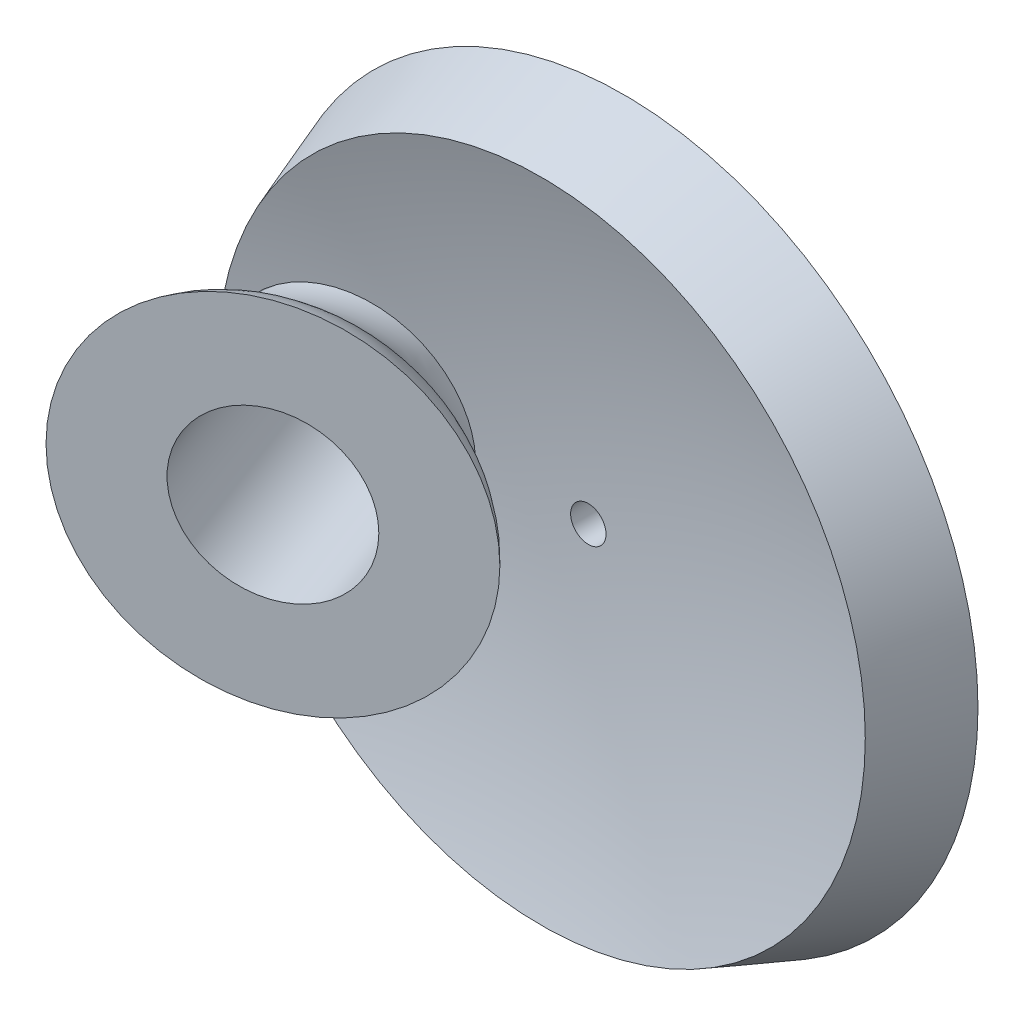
ISO-10303-21;
HEADER;
FILE_DESCRIPTION(('STEP AP214'),'2;1');
FILE_NAME('part.step','',(''),(''),'','','');
FILE_SCHEMA(('AUTOMOTIVE_DESIGN { 1 0 10303 214 1 1 1 1 }'));
ENDSEC;
DATA;
#1=APPLICATION_CONTEXT('core data for automotive mechanical design processes');
#2=APPLICATION_PROTOCOL_DEFINITION('international standard','automotive_design',2000,#1);
#3=PRODUCT_CONTEXT('',#1,'mechanical');
#4=PRODUCT('Part','Part','',(#3));
#5=PRODUCT_RELATED_PRODUCT_CATEGORY('part','',(#4));
#6=PRODUCT_DEFINITION_FORMATION('','',#4);
#7=PRODUCT_DEFINITION_CONTEXT('part definition',#1,'design');
#8=PRODUCT_DEFINITION('design','',#6,#7);
#9=PRODUCT_DEFINITION_SHAPE('','',#8);
#10=(LENGTH_UNIT() NAMED_UNIT(*) SI_UNIT(.MILLI.,.METRE.));
#11=(NAMED_UNIT(*) PLANE_ANGLE_UNIT() SI_UNIT($,.RADIAN.));
#12=(NAMED_UNIT(*) SI_UNIT($,.STERADIAN.) SOLID_ANGLE_UNIT());
#13=UNCERTAINTY_MEASURE_WITH_UNIT(LENGTH_MEASURE(1.E-05),#10,'distance_accuracy_value','');
#14=(GEOMETRIC_REPRESENTATION_CONTEXT(3) GLOBAL_UNCERTAINTY_ASSIGNED_CONTEXT((#13)) GLOBAL_UNIT_ASSIGNED_CONTEXT((#10,
#11,#12)) REPRESENTATION_CONTEXT('',''));
#15=CARTESIAN_POINT('',(0.,0.,0.));
#16=DIRECTION('',(0.,0.,1.));
#17=DIRECTION('',(1.,0.,0.));
#18=AXIS2_PLACEMENT_3D('',#15,#16,#17);
#19=CARTESIAN_POINT('',(0.,0.,99.2029679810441));
#20=DIRECTION('',(0.,0.,1.));
#21=DIRECTION('',(1.,0.,0.));
#22=AXIS2_PLACEMENT_3D('',#19,#20,#21);
#23=SPHERICAL_SURFACE('',#22,96.2029679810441);
#24=CARTESIAN_POINT('',(0.,0.,7.));
#25=DIRECTION('',(0.,0.,1.));
#26=DIRECTION('',(1.,0.,0.));
#27=AXIS2_PLACEMENT_3D('',#24,#25,#26);
#28=CIRCLE('',#27,27.4522083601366);
#29=CARTESIAN_POINT('',(27.4522083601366,0.,7.));
#30=VERTEX_POINT('',#29);
#31=EDGE_CURVE('E52',#30,#30,#28,.T.);
#32=ORIENTED_EDGE('',*,*,#31,.T.);
#33=EDGE_LOOP('',(#32));
#34=FACE_BOUND('',#33,.T.);
#35=CARTESIAN_POINT('',(0.,0.,3.01169473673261));
#36=DIRECTION('',(0.,0.,1.));
#37=DIRECTION('',(1.,0.,0.));
#38=AXIS2_PLACEMENT_3D('',#35,#36,#37);
#39=CIRCLE('',#38,1.5);
#40=CARTESIAN_POINT('',(1.5,0.,3.01169473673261));
#41=VERTEX_POINT('',#40);
#42=EDGE_CURVE('E92',#41,#41,#39,.T.);
#43=ORIENTED_EDGE('',*,*,#42,.F.);
#44=EDGE_LOOP('',(#43));
#45=FACE_BOUND('',#44,.T.);
#46=CARTESIAN_POINT('',(-9.39672620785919,0.49956979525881,3.46132074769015));
#47=CARTESIAN_POINT('',(-9.41056295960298,0.749809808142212,3.46398465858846));
#48=CARTESIAN_POINT('',(-9.43480235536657,0.999497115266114,3.46865138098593));
#49=CARTESIAN_POINT('',(-9.50391822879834,1.49599468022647,3.48195930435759));
#50=CARTESIAN_POINT('',(-9.54880500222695,1.74280343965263,3.49060248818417));
#51=CARTESIAN_POINT('',(-9.6589603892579,2.23207215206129,3.51181650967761));
#52=CARTESIAN_POINT('',(-9.72426093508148,2.47452465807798,3.5243935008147));
#53=CARTESIAN_POINT('',(-9.87472269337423,2.95295573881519,3.55337806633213));
#54=CARTESIAN_POINT('',(-9.95988443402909,3.18893414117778,3.56978574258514));
#55=CARTESIAN_POINT('',(-10.1493192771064,3.65250198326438,3.6062914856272));
#56=CARTESIAN_POINT('',(-10.2535721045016,3.88010001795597,3.62638563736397));
#57=CARTESIAN_POINT('',(-10.4804674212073,4.32558729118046,3.67013011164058));
#58=CARTESIAN_POINT('',(-10.6031104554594,4.54347624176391,3.69378053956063));
#59=CARTESIAN_POINT('',(-10.865792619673,4.96790825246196,3.7444514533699));
#60=CARTESIAN_POINT('',(-11.0058214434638,5.17445793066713,3.77146994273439));
#61=CARTESIAN_POINT('',(-11.3023532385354,5.57501124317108,3.82870497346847));
#62=CARTESIAN_POINT('',(-11.4588619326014,5.76901048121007,3.85892262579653));
#63=CARTESIAN_POINT('',(-11.7882137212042,6.14426031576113,3.92253524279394));
#64=CARTESIAN_POINT('',(-11.9611538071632,6.3254225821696,3.95594908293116));
#65=CARTESIAN_POINT('',(-12.3212702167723,6.67242183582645,4.02555536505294));
#66=CARTESIAN_POINT('',(-12.5084469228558,6.83825841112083,4.06174788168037));
#67=CARTESIAN_POINT('',(-12.895707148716,7.15351322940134,4.13666068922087));
#68=CARTESIAN_POINT('',(-13.0957919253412,7.30292986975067,4.17538122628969));
#69=CARTESIAN_POINT('',(-13.507436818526,7.58434767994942,4.25507900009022));
#70=CARTESIAN_POINT('',(-13.7189972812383,7.71634832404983,4.29605630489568));
#71=CARTESIAN_POINT('',(-14.1546859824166,7.96353574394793,4.38048494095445));
#72=CARTESIAN_POINT('',(-14.3789338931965,8.07850354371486,4.42395992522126));
#73=CARTESIAN_POINT('',(-14.8361408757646,8.2890017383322,4.51264244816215));
#74=CARTESIAN_POINT('',(-15.0691029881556,8.3845252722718,4.55785059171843));
#75=CARTESIAN_POINT('',(-15.5419383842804,8.55543009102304,4.64965447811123));
#76=CARTESIAN_POINT('',(-15.781809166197,8.63081856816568,4.69624971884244));
#77=CARTESIAN_POINT('',(-16.2669747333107,8.76103893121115,4.79054233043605));
#78=CARTESIAN_POINT('',(-16.5122719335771,8.81586146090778,4.83824019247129));
#79=CARTESIAN_POINT('',(-17.0090405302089,8.90500664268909,4.93488673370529));
#80=CARTESIAN_POINT('',(-17.2605495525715,8.93911124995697,4.98384324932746));
#81=CARTESIAN_POINT('',(-17.7653670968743,8.98568952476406,5.08215835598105));
#82=CARTESIAN_POINT('',(-18.0186747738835,8.99817275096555,5.13151675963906));
#83=CARTESIAN_POINT('',(-18.5255250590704,9.0014552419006,5.23033116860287));
#84=CARTESIAN_POINT('',(-18.7790677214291,8.99224518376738,5.279787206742));
#85=CARTESIAN_POINT('',(-19.2844019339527,8.95218686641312,5.37840887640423));
#86=CARTESIAN_POINT('',(-19.536194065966,8.92134618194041,5.42757460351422));
#87=CARTESIAN_POINT('',(-20.0374108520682,8.83805615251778,5.52549363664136));
#88=CARTESIAN_POINT('',(-20.2868207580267,8.78551487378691,5.57424427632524));
#89=CARTESIAN_POINT('',(-20.7803833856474,8.65916505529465,5.67076606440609));
#90=CARTESIAN_POINT('',(-21.0245362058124,8.58535691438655,5.71853723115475));
#91=CARTESIAN_POINT('',(-21.5058382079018,8.41696166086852,5.81275462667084));
#92=CARTESIAN_POINT('',(-21.7429872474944,8.32237412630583,5.85920082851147));
#93=CARTESIAN_POINT('',(-22.2085517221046,8.11305773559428,5.95042489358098));
#94=CARTESIAN_POINT('',(-22.4369673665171,7.99832936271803,5.99520279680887));
#95=CARTESIAN_POINT('',(-22.8825763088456,7.74996668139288,6.08259699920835));
#96=CARTESIAN_POINT('',(-23.0998078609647,7.61640360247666,6.1252206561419));
#97=CARTESIAN_POINT('',(-23.522278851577,7.33101563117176,6.20814913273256));
#98=CARTESIAN_POINT('',(-23.7275225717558,7.17919731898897,6.24845478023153));
#99=CARTESIAN_POINT('',(-24.124608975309,6.85828351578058,6.32646430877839));
#100=CARTESIAN_POINT('',(-24.3164497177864,6.68918553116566,6.36416781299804));
#101=CARTESIAN_POINT('',(-24.6852571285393,6.33491135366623,6.43667710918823));
#102=CARTESIAN_POINT('',(-24.8622239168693,6.14973529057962,6.4714829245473));
#103=CARTESIAN_POINT('',(-25.1982435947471,5.76654954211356,6.53759236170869));
#104=CARTESIAN_POINT('',(-25.3574585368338,5.56868741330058,6.56892764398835));
#105=CARTESIAN_POINT('',(-25.6587970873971,5.159878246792,6.6282511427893));
#106=CARTESIAN_POINT('',(-25.8009208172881,4.94893130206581,6.65623938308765));
#107=CARTESIAN_POINT('',(-26.0669888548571,4.51546098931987,6.70864864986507));
#108=CARTESIAN_POINT('',(-26.1909340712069,4.29293820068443,6.73306985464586));
#109=CARTESIAN_POINT('',(-26.4196997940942,3.83790486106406,6.77815339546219));
#110=CARTESIAN_POINT('',(-26.5245204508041,3.60539438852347,6.79881576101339));
#111=CARTESIAN_POINT('',(-26.7131106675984,3.13485032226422,6.83599708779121));
#112=CARTESIAN_POINT('',(-26.7971127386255,2.89691350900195,6.85256180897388));
#113=CARTESIAN_POINT('',(-26.9450025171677,2.41463280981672,6.88172847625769));
#114=CARTESIAN_POINT('',(-27.0088904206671,2.1702889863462,6.89433046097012));
#115=CARTESIAN_POINT('',(-27.1160587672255,1.67696131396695,6.91547137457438));
#116=CARTESIAN_POINT('',(-27.1593400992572,1.42797766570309,6.92401047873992));
#117=CARTESIAN_POINT('',(-27.2249648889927,0.927159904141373,6.93695835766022));
#118=CARTESIAN_POINT('',(-27.2473084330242,0.675325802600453,6.94136714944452));
#119=CARTESIAN_POINT('',(-27.270786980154,0.172731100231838,6.9459999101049));
#120=CARTESIAN_POINT('',(-27.2720966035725,-0.0780210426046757,6.94625833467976));
#121=CARTESIAN_POINT('',(-27.253944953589,-0.578741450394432,6.94267665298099));
#122=CARTESIAN_POINT('',(-27.234483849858,-0.828709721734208,6.93883658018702));
#123=CARTESIAN_POINT('',(-27.1749398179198,-1.32607621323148,6.92708825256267));
#124=CARTESIAN_POINT('',(-27.1348572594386,-1.57347447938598,6.91918007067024));
#125=CARTESIAN_POINT('',(-27.034375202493,-2.06394652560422,6.89935757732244));
#126=CARTESIAN_POINT('',(-26.9739756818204,-2.3070203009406,6.88744326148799));
#127=CARTESIAN_POINT('',(-26.8334272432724,-2.78674594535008,6.85972326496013));
#128=CARTESIAN_POINT('',(-26.7533094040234,-3.02340727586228,6.84392370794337));
#129=CARTESIAN_POINT('',(-26.5738461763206,-3.48912459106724,6.80853975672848));
#130=CARTESIAN_POINT('',(-26.4744941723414,-3.71817792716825,6.78895406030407));
#131=CARTESIAN_POINT('',(-26.2573388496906,-4.16696130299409,6.74615521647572));
#132=CARTESIAN_POINT('',(-26.1395386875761,-4.3866929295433,6.72294268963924));
#133=CARTESIAN_POINT('',(-25.8863412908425,-4.81536550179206,6.67306346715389));
#134=CARTESIAN_POINT('',(-25.7509436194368,-5.02430617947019,6.64639668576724));
#135=CARTESIAN_POINT('',(-25.4626793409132,-5.43118507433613,6.58963966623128));
#136=CARTESIAN_POINT('',(-25.3097127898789,-5.62904975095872,6.55952984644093));
#137=CARTESIAN_POINT('',(-24.9880891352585,-6.01106630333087,6.49624287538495));
#138=CARTESIAN_POINT('',(-24.8194316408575,-6.19521783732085,6.4630656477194));
#139=CARTESIAN_POINT('',(-24.4676741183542,-6.54853733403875,6.39389536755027));
#140=CARTESIAN_POINT('',(-24.2845761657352,-6.71770744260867,6.35790271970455));
#141=CARTESIAN_POINT('',(-23.9051601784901,-7.04002432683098,6.28334789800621));
#142=CARTESIAN_POINT('',(-23.7088375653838,-7.19316550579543,6.24478483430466));
#143=CARTESIAN_POINT('',(-23.3022482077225,-7.48390157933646,6.16495300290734));
#144=CARTESIAN_POINT('',(-23.0918546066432,-7.62131234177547,6.12365967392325));
#145=CARTESIAN_POINT('',(-22.6605345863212,-7.87776098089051,6.03904338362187));
#146=CARTESIAN_POINT('',(-22.4396078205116,-7.99679825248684,5.99572035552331));
#147=CARTESIAN_POINT('',(-21.9887814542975,-8.21571857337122,5.90735579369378));
#148=CARTESIAN_POINT('',(-21.7588815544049,-8.31560098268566,5.86231420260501));
#149=CARTESIAN_POINT('',(-21.2917258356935,-8.49555923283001,5.77083388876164));
#150=CARTESIAN_POINT('',(-21.0544699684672,-8.5756349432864,5.7243951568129));
#151=CARTESIAN_POINT('',(-20.5715441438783,-8.71625296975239,5.62991754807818));
#152=CARTESIAN_POINT('',(-20.325809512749,-8.77656510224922,5.58186653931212));
#153=CARTESIAN_POINT('',(-19.8302428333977,-8.87601345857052,5.48501283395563));
#154=CARTESIAN_POINT('',(-19.5804108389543,-8.91514996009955,5.43621014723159));
#155=CARTESIAN_POINT('',(-19.078344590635,-8.97200226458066,5.33818633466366));
#156=CARTESIAN_POINT('',(-18.8261098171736,-8.98971332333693,5.28896511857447));
#157=CARTESIAN_POINT('',(-18.32114689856,-9.00358372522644,5.19047783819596));
#158=CARTESIAN_POINT('',(-18.068418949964,-8.99975038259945,5.14121179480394));
#159=CARTESIAN_POINT('',(-17.56238628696,-8.97047342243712,5.04261874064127));
#160=CARTESIAN_POINT('',(-17.3090899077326,-8.94487880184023,4.99329371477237));
#161=CARTESIAN_POINT('',(-16.8055072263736,-8.87205004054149,4.89528097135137));
#162=CARTESIAN_POINT('',(-16.5552208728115,-8.82481627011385,4.84659324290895));
#163=CARTESIAN_POINT('',(-16.059426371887,-8.70902005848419,4.75019685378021));
#164=CARTESIAN_POINT('',(-15.8139184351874,-8.64045667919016,4.70248823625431));
#165=CARTESIAN_POINT('',(-15.3294569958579,-8.48245972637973,4.60839201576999));
#166=CARTESIAN_POINT('',(-15.0905033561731,-8.39302658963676,4.56200438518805));
#167=CARTESIAN_POINT('',(-14.6209912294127,-8.19393929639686,4.47090328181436));
#168=CARTESIAN_POINT('',(-14.3904284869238,-8.08429556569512,4.4261889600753));
#169=CARTESIAN_POINT('',(-13.9393269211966,-7.84553848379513,4.33874526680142));
#170=CARTESIAN_POINT('',(-13.7187845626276,-7.71643206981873,4.29601519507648));
#171=CARTESIAN_POINT('',(-13.2892423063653,-7.43959030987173,4.21282846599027));
#172=CARTESIAN_POINT('',(-13.080243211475,-7.29185367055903,4.17237196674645));
#173=CARTESIAN_POINT('',(-12.6753594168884,-6.97877669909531,4.09403040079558));
#174=CARTESIAN_POINT('',(-12.4794745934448,-6.81343653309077,4.05614530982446));
#175=CARTESIAN_POINT('',(-12.1038798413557,-6.46776600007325,3.98353171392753));
#176=CARTESIAN_POINT('',(-11.9240477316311,-6.28757340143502,3.94877934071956));
#177=CARTESIAN_POINT('',(-11.5800750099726,-5.91226452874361,3.88233047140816));
#178=CARTESIAN_POINT('',(-11.41593429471,-5.71714835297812,3.85063395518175));
#179=CARTESIAN_POINT('',(-11.1045233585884,-5.31327799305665,3.79051784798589));
#180=CARTESIAN_POINT('',(-10.9572603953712,-5.10451800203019,3.7620996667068));
#181=CARTESIAN_POINT('',(-10.6808247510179,-4.67493131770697,3.70876922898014));
#182=CARTESIAN_POINT('',(-10.5516513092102,-4.45410513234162,3.68385682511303));
#183=CARTESIAN_POINT('',(-10.3137540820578,-4.00454491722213,3.63798691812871));
#184=CARTESIAN_POINT('',(-10.2048146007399,-3.77592926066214,3.61698769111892));
#185=CARTESIAN_POINT('',(-10.0064341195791,-3.31009170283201,3.57875522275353));
#186=CARTESIAN_POINT('',(-9.91699232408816,-3.07287015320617,3.56152182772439));
#187=CARTESIAN_POINT('',(-9.75843898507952,-2.59196026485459,3.53097683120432));
#188=CARTESIAN_POINT('',(-9.68929149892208,-2.3482842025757,3.51765829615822));
#189=CARTESIAN_POINT('',(-9.571680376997,-1.85591722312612,3.49500754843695));
#190=CARTESIAN_POINT('',(-9.52320554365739,-1.60722909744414,3.48567317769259));
#191=CARTESIAN_POINT('',(-9.46368549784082,-1.21482595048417,3.47421263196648));
#192=CARTESIAN_POINT('',(-9.4455180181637,-1.07219249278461,3.47071468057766));
#193=CARTESIAN_POINT('',(-9.41600667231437,-0.786295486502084,3.46503273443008));
#194=CARTESIAN_POINT('',(-9.40465773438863,-0.643032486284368,3.46284776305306));
#195=CARTESIAN_POINT('',(-9.38753352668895,-0.333295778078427,3.4595509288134));
#196=CARTESIAN_POINT('',(-9.38293143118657,-0.166753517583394,3.4586649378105));
#197=CARTESIAN_POINT('',(-9.3829224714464,0.166463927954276,3.45866321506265));
#198=CARTESIAN_POINT('',(-9.38752360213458,0.333139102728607,3.45954902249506));
#199=CARTESIAN_POINT('',(-9.39672620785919,0.49956979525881,3.46132074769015));
#200=B_SPLINE_CURVE_WITH_KNOTS('',3,(#46,#47,#48,#49,#50,#51,#52,#53,#54,#55,#56,#57,#58,#59,
#60,#61,#62,#63,#64,#65,#66,#67,#68,#69,#70,#71,#72,#73,#74,#75,#76,#77,#78,#79,#80,#81,#82,#83,
#84,#85,#86,#87,#88,#89,#90,#91,#92,#93,#94,#95,#96,#97,#98,#99,#100,#101,#102,#103,#104,#105,
#106,#107,#108,#109,#110,#111,#112,#113,#114,#115,#116,#117,#118,#119,#120,#121,#122,#123,#124,
#125,#126,#127,#128,#129,#130,#131,#132,#133,#134,#135,#136,#137,#138,#139,#140,#141,#142,#143,
#144,#145,#146,#147,#148,#149,#150,#151,#152,#153,#154,#155,#156,#157,#158,#159,#160,#161,#162,
#163,#164,#165,#166,#167,#168,#169,#170,#171,#172,#173,#174,#175,#176,#177,#178,#179,#180,#181,
#182,#183,#184,#185,#186,#187,#188,#189,#190,#191,#192,#193,#194,#195,#196,#197,#198,#199),
.UNSPECIFIED.,.T.,.F.,(4,2,2,2,2,2,2,2,2,2,2,2,2,2,2,2,2,2,2,2,2,2,2,2,2,2,2,2,2,2,2,2,2,2,2,2,
2,2,2,2,2,2,2,2,2,2,2,2,2,2,2,2,2,2,2,2,2,2,2,2,2,2,2,2,2,2,2,2,2,2,2,2,2,2,2,2,4),(0.,
0.751761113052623,1.50389749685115,2.25721634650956,3.01055523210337,3.76309865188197,
4.51566437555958,5.26778609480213,6.02016986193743,6.77730918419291,7.53446885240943,
8.29170235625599,9.04895871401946,9.81523395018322,10.5817790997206,11.348050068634,
12.1146692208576,12.8892228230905,13.6634339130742,14.4379777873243,15.212250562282,
15.989837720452,16.7674102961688,17.5449986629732,18.3225683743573,19.0972726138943,
19.8716984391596,20.6462361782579,21.4207676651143,22.1875209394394,22.9542687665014,
23.7209782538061,24.4876817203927,25.2453915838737,26.0030940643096,26.7607638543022,
27.5184305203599,28.2698038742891,29.0211710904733,29.7725248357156,30.5238794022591,
31.2740572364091,32.0244935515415,32.774801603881,33.5251282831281,34.2799571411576,
35.034804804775,35.789544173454,36.5445461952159,37.3076369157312,38.0707527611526,
38.8338940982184,39.5970404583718,40.3687828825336,41.1405151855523,41.9124183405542,
42.6840594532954,43.4610991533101,44.2381255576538,45.0151861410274,45.7922304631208,
46.5688750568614,47.3452434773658,48.1216658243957,48.8980808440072,49.6679659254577,
50.4378459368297,51.2080557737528,51.9782332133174,52.7396589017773,53.5010535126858,
54.2610913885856,55.0207170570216,55.452054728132,55.8830711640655,56.3826214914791,
56.882605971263),.UNSPECIFIED.);
#201=CARTESIAN_POINT('',(-23.2291346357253,7.52838485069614,6.15060759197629));
#202=VERTEX_POINT('',#201);
#203=CARTESIAN_POINT('',(-23.2291346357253,-7.5283848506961,6.15060759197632));
#204=VERTEX_POINT('',#203);
#205=EDGE_CURVE('E48',#202,#204,#200,.T.);
#206=ORIENTED_EDGE('',*,*,#205,.F.);
#207=CARTESIAN_POINT('',(-23.2291346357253,7.52838485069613,6.15060759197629));
#208=CARTESIAN_POINT('',(-23.0115906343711,7.671902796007,6.10790939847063));
#209=CARTESIAN_POINT('',(-22.7880019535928,7.8058862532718,6.06406074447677));
#210=CARTESIAN_POINT('',(-22.3304860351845,8.05401526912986,5.97441625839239));
#211=CARTESIAN_POINT('',(-22.0965602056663,8.16816351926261,5.92862069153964));
#212=CARTESIAN_POINT('',(-21.6203206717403,8.37577928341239,5.83547516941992));
#213=CARTESIAN_POINT('',(-21.3780163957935,8.46926922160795,5.78812696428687));
#214=CARTESIAN_POINT('',(-20.8865326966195,8.6351616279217,5.69218066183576));
#215=CARTESIAN_POINT('',(-20.6373531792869,8.70756380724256,5.64358254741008));
#216=CARTESIAN_POINT('',(-20.1339391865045,8.83083289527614,5.54549906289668));
#217=CARTESIAN_POINT('',(-19.8797055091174,8.88170317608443,5.49601383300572));
#218=CARTESIAN_POINT('',(-19.3678437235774,8.96164334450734,5.39648512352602));
#219=CARTESIAN_POINT('',(-19.1102144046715,8.99070522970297,5.34644144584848));
#220=CARTESIAN_POINT('',(-18.5935061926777,9.02683139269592,5.24617757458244));
#221=CARTESIAN_POINT('',(-18.3344275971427,9.03390003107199,5.1959574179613));
#222=CARTESIAN_POINT('',(-17.8165674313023,9.02602160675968,5.0956808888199));
#223=CARTESIAN_POINT('',(-17.5577858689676,9.01107396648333,5.0456245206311));
#224=CARTESIAN_POINT('',(-17.0399315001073,8.95902105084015,4.94556191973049));
#225=CARTESIAN_POINT('',(-16.7808782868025,8.92171139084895,4.89556046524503));
#226=CARTESIAN_POINT('',(-16.2667555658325,8.82500331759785,4.79643269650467));
#227=CARTESIAN_POINT('',(-16.0116860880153,8.76560473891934,4.74730638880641));
#228=CARTESIAN_POINT('',(-15.5073249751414,8.62508223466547,4.65026959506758));
#229=CARTESIAN_POINT('',(-15.2580341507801,8.5439552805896,4.60235927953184));
#230=CARTESIAN_POINT('',(-14.767084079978,8.36049327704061,4.508103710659));
#231=CARTESIAN_POINT('',(-14.5254245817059,8.25815892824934,4.46175840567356));
#232=CARTESIAN_POINT('',(-14.0519893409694,8.03315860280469,4.3710555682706));
#233=CARTESIAN_POINT('',(-13.8201946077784,7.91053414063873,4.32669420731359));
#234=CARTESIAN_POINT('',(-13.3677891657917,7.6456448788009,4.24019670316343));
#235=CARTESIAN_POINT('',(-13.147174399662,7.50338727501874,4.19805975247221));
#236=CARTESIAN_POINT('',(-12.7187074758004,7.20011604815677,4.11630001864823));
#237=CARTESIAN_POINT('',(-12.5108564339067,7.03910078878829,4.07667745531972));
#238=CARTESIAN_POINT('',(-12.1095706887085,6.69940436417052,4.00024800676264));
#239=CARTESIAN_POINT('',(-11.9161357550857,6.52072348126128,3.96344107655));
#240=CARTESIAN_POINT('',(-11.5484526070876,6.15016312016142,3.89353545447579));
#241=CARTESIAN_POINT('',(-11.3739301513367,5.95856577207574,3.86038358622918));
#242=CARTESIAN_POINT('',(-11.0417069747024,5.56080677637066,3.79732181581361));
#243=CARTESIAN_POINT('',(-10.8840058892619,5.35464544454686,3.76741184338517));
#244=CARTESIAN_POINT('',(-10.5867321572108,4.92921945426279,3.71106741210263));
#245=CARTESIAN_POINT('',(-10.4471578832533,4.70995597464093,3.68463264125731));
#246=CARTESIAN_POINT('',(-10.187300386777,4.25988724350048,3.63544503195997));
#247=CARTESIAN_POINT('',(-10.0670167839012,4.02908221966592,3.61269212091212));
#248=CARTESIAN_POINT('',(-9.84959372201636,3.56365795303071,3.57158408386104));
#249=CARTESIAN_POINT('',(-9.75194158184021,3.32928671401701,3.55313147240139));
#250=CARTESIAN_POINT('',(-9.57676100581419,2.85288097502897,3.52004134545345));
#251=CARTESIAN_POINT('',(-9.49923207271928,2.61084666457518,3.50540373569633));
#252=CARTESIAN_POINT('',(-9.36496676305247,2.1209051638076,3.48006121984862));
#253=CARTESIAN_POINT('',(-9.30822801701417,1.87299864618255,3.46935586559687));
#254=CARTESIAN_POINT('',(-9.21602332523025,1.37312176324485,3.45196189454));
#255=CARTESIAN_POINT('',(-9.18055711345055,1.12115144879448,3.44527322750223));
#256=CARTESIAN_POINT('',(-9.13173522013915,0.620449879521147,3.43606641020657));
#257=CARTESIAN_POINT('',(-9.11792278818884,0.371764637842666,3.43346210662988));
#258=CARTESIAN_POINT('',(-9.11108233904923,-0.125899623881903,3.43217231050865));
#259=CARTESIAN_POINT('',(-9.11805401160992,-0.37487863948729,3.43348675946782));
#260=CARTESIAN_POINT('',(-9.1527216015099,-0.871323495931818,3.4400239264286));
#261=CARTESIAN_POINT('',(-9.18041640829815,-1.11878941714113,3.44524643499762));
#262=CARTESIAN_POINT('',(-9.25629600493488,-1.61044577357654,3.45955871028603));
#263=CARTESIAN_POINT('',(-9.30448080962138,-1.85463620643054,3.46864847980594));
#264=CARTESIAN_POINT('',(-9.42056732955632,-2.33646389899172,3.49055481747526));
#265=CARTESIAN_POINT('',(-9.48834168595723,-2.57413296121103,3.5033473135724));
#266=CARTESIAN_POINT('',(-9.643198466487,-3.04295238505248,3.53258912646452));
#267=CARTESIAN_POINT('',(-9.73028748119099,-3.27410049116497,3.54903969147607));
#268=CARTESIAN_POINT('',(-9.92304786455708,-3.72817916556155,3.58546954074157));
#269=CARTESIAN_POINT('',(-10.0287162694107,-3.95111103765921,3.60544826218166));
#270=CARTESIAN_POINT('',(-10.2578194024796,-4.38731253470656,3.64879046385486));
#271=CARTESIAN_POINT('',(-10.3812547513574,-4.6005818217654,3.67215406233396));
#272=CARTESIAN_POINT('',(-10.6465114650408,-5.01852766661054,3.72239485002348));
#273=CARTESIAN_POINT('',(-10.7885339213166,-5.22307196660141,3.74931049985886));
#274=CARTESIAN_POINT('',(-11.0887139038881,-5.61950059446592,3.8062420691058));
#275=CARTESIAN_POINT('',(-11.2468718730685,-5.81138457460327,3.8362580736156));
#276=CARTESIAN_POINT('',(-11.578122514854,-6.18124759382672,3.89917519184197));
#277=CARTESIAN_POINT('',(-11.751213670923,-6.3592280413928,3.93207601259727));
#278=CARTESIAN_POINT('',(-12.1111437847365,-6.70025747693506,4.0005496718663));
#279=CARTESIAN_POINT('',(-12.2979872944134,-6.86330148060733,4.03612339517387));
#280=CARTESIAN_POINT('',(-12.6885745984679,-7.17704127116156,4.11055595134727));
#281=CARTESIAN_POINT('',(-12.8926117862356,-7.32735825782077,4.14947222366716));
#282=CARTESIAN_POINT('',(-13.3121724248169,-7.61032165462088,4.22957301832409));
#283=CARTESIAN_POINT('',(-13.5276961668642,-7.74296761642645,4.27075759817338));
#284=CARTESIAN_POINT('',(-13.9687595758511,-7.98981451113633,4.35512492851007));
#285=CARTESIAN_POINT('',(-14.1943018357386,-8.1040106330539,4.39830819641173));
#286=CARTESIAN_POINT('',(-14.6537159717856,-8.31320423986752,4.48635951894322));
#287=CARTESIAN_POINT('',(-14.8875853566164,-8.40820741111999,4.53122706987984));
#288=CARTESIAN_POINT('',(-15.3678752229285,-8.5805625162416,4.62346574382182));
#289=CARTESIAN_POINT('',(-15.6144624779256,-8.65743164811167,4.67087117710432));
#290=CARTESIAN_POINT('',(-16.1130366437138,-8.7900192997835,4.76682288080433));
#291=CARTESIAN_POINT('',(-16.3650235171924,-8.84573796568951,4.81536914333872));
#292=CARTESIAN_POINT('',(-16.872685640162,-8.93569254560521,4.91327721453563));
#293=CARTESIAN_POINT('',(-17.1283614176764,-8.9699253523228,4.96263914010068));
#294=CARTESIAN_POINT('',(-17.6415962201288,-9.01668287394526,5.06183233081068));
#295=CARTESIAN_POINT('',(-17.8991552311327,-9.02920774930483,5.11166359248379));
#296=CARTESIAN_POINT('',(-18.4181563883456,-9.03248793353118,5.21218328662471));
#297=CARTESIAN_POINT('',(-18.6796002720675,-9.02292240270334,5.26287360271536));
#298=CARTESIAN_POINT('',(-19.2006543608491,-8.98141130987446,5.36400476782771));
#299=CARTESIAN_POINT('',(-19.4602651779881,-8.94947361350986,5.41444569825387));
#300=CARTESIAN_POINT('',(-19.9758531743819,-8.86341225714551,5.5147240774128));
#301=CARTESIAN_POINT('',(-20.2318311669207,-8.8092936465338,5.56456166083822));
#302=CARTESIAN_POINT('',(-20.7382668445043,-8.67923551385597,5.6632596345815));
#303=CARTESIAN_POINT('',(-20.9887256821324,-8.60330059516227,5.71212022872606));
#304=CARTESIAN_POINT('',(-21.5860029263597,-8.39365479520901,5.82875081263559));
#305=CARTESIAN_POINT('',(-21.9292309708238,-8.24906669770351,5.89586694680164));
#306=CARTESIAN_POINT('',(-22.4288673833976,-8.00144628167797,5.99369006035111));
#307=CARTESIAN_POINT('',(-22.5928264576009,-7.91381742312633,6.02581235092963));
#308=CARTESIAN_POINT('',(-22.9152448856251,-7.72854540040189,6.08901775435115));
#309=CARTESIAN_POINT('',(-23.0737029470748,-7.63089990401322,6.12010062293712));
#310=CARTESIAN_POINT('',(-23.2291346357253,-7.5283848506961,6.1506075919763));
#311=B_SPLINE_CURVE_WITH_KNOTS('',3,(#207,#208,#209,#210,#211,#212,#213,#214,#215,#216,#217,
#218,#219,#220,#221,#222,#223,#224,#225,#226,#227,#228,#229,#230,#231,#232,#233,#234,#235,#236,
#237,#238,#239,#240,#241,#242,#243,#244,#245,#246,#247,#248,#249,#250,#251,#252,#253,#254,#255,
#256,#257,#258,#259,#260,#261,#262,#263,#264,#265,#266,#267,#268,#269,#270,#271,#272,#273,#274,
#275,#276,#277,#278,#279,#280,#281,#282,#283,#284,#285,#286,#287,#288,#289,#290,#291,#292,#293,
#294,#295,#296,#297,#298,#299,#300,#301,#302,#303,#304,#305,#306,#307,#308,#309,#310),
.UNSPECIFIED.,.F.,.F.,(4,2,2,2,2,2,2,2,2,2,2,2,2,2,2,2,2,2,2,2,2,2,2,2,2,2,2,2,2,2,2,2,2,2,2,2,
2,2,2,2,2,2,2,2,2,2,2,2,2,2,2,4),(0.,0.792019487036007,1.58393141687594,2.37497947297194,
3.16603836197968,3.95697331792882,4.74819835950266,5.5392665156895,6.33035542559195,
7.12878741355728,7.92722538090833,8.72577469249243,9.52429762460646,10.3212064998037,
11.117824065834,11.914511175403,12.7111855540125,13.494064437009,14.2769263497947,
15.0597179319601,15.8424940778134,16.6052762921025,17.3680396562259,18.1307160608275,
18.8933829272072,19.6397351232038,20.3860761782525,21.1323772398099,21.8786788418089,
22.6202335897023,23.3620417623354,24.1037317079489,24.8454475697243,25.5959791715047,
26.3465313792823,27.0970074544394,27.8477330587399,28.6160472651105,29.3843809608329,
30.1529146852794,30.9212203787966,31.7081192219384,32.4950126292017,33.282019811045,
34.0690211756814,34.8675246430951,35.6657475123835,36.4637887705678,37.2616617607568,
38.3938028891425,38.9594964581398,39.5253220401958),.UNSPECIFIED.);
#312=EDGE_CURVE('E34',#202,#204,#311,.T.);
#313=ORIENTED_EDGE('',*,*,#312,.T.);
#314=EDGE_LOOP('',(#206,#313));
#315=FACE_BOUND('',#314,.T.);
#316=ADVANCED_FACE('F26',(#34,#45,#315),#23,.F.);
#317=CARTESIAN_POINT('',(0.,0.,0.));
#318=DIRECTION('',(0.,0.,1.));
#319=DIRECTION('',(1.,0.,0.));
#320=AXIS2_PLACEMENT_3D('',#317,#318,#319);
#321=PLANE('',#320);
#322=CARTESIAN_POINT('',(0.,0.,0.));
#323=DIRECTION('',(0.,0.,1.));
#324=DIRECTION('',(1.,0.,0.));
#325=AXIS2_PLACEMENT_3D('',#322,#323,#324);
#326=CIRCLE('',#325,30.);
#327=CARTESIAN_POINT('',(30.,0.,0.));
#328=VERTEX_POINT('',#327);
#329=EDGE_CURVE('E58',#328,#328,#326,.T.);
#330=ORIENTED_EDGE('',*,*,#329,.F.);
#331=EDGE_LOOP('',(#330));
#332=FACE_BOUND('',#331,.T.);
#333=CARTESIAN_POINT('',(-20.2193776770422,0.,0.));
#334=DIRECTION('',(0.,0.,1.));
#335=DIRECTION('',(1.,0.,0.));
#336=AXIS2_PLACEMENT_3D('',#333,#334,#335);
#337=ELLIPSE('',#336,7.44924440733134,7.);
#338=CARTESIAN_POINT('',(-12.7701332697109,0.,0.));
#339=VERTEX_POINT('',#338);
#340=EDGE_CURVE('E94',#339,#339,#337,.T.);
#341=ORIENTED_EDGE('',*,*,#340,.T.);
#342=EDGE_LOOP('',(#341));
#343=FACE_BOUND('',#342,.T.);
#344=CARTESIAN_POINT('',(0.,0.,0.));
#345=DIRECTION('',(0.,0.,1.));
#346=DIRECTION('',(1.,0.,0.));
#347=AXIS2_PLACEMENT_3D('',#344,#345,#346);
#348=CIRCLE('',#347,6.);
#349=CARTESIAN_POINT('',(6.,0.,0.));
#350=VERTEX_POINT('',#349);
#351=EDGE_CURVE('E51',#350,#350,#348,.F.);
#352=ORIENTED_EDGE('',*,*,#351,.F.);
#353=EDGE_LOOP('',(#352));
#354=FACE_BOUND('',#353,.T.);
#355=ADVANCED_FACE('F70',(#332,#343,#354),#321,.F.);
#356=CARTESIAN_POINT('',(0.,0.,0.));
#357=DIRECTION('',(0.,0.,-1.));
#358=DIRECTION('',(1.,0.,0.));
#359=AXIS2_PLACEMENT_3D('',#356,#357,#358);
#360=CONICAL_SURFACE('',#359,30.,0.349065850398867);
#361=ORIENTED_EDGE('',*,*,#31,.F.);
#362=EDGE_LOOP('',(#361));
#363=FACE_BOUND('',#362,.T.);
#364=ORIENTED_EDGE('',*,*,#329,.T.);
#365=EDGE_LOOP('',(#364));
#366=FACE_BOUND('',#365,.T.);
#367=ADVANCED_FACE('F72',(#363,#366),#360,.T.);
#368=CARTESIAN_POINT('',(-21.3634931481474,0.,-3.14343142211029));
#369=DIRECTION('',(0.342020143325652,0.,0.939692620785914));
#370=DIRECTION('',(0.939692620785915,0.,-0.342020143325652));
#371=AXIS2_PLACEMENT_3D('',#368,#369,#370);
#372=CYLINDRICAL_SURFACE('',#371,7.);
#373=ORIENTED_EDGE('',*,*,#340,.F.);
#374=EDGE_LOOP('',(#373));
#375=FACE_BOUND('',#374,.T.);
#376=CARTESIAN_POINT('',(-14.7759785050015,0.,14.9556163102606));
#377=DIRECTION('',(0.342020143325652,0.,0.939692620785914));
#378=DIRECTION('',(0.939692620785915,0.,-0.342020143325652));
#379=AXIS2_PLACEMENT_3D('',#376,#377,#378);
#380=CIRCLE('',#379,7.00000000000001);
#381=CARTESIAN_POINT('',(-8.19813015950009,0.,12.5614753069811));
#382=VERTEX_POINT('',#381);
#383=EDGE_CURVE('E155',#382,#382,#380,.T.);
#384=ORIENTED_EDGE('',*,*,#383,.T.);
#385=EDGE_LOOP('',(#384));
#386=FACE_BOUND('',#385,.T.);
#387=ADVANCED_FACE('F68',(#375,#386),#372,.F.);
#388=CARTESIAN_POINT('',(0.,0.,-5.));
#389=DIRECTION('',(0.,0.,1.));
#390=DIRECTION('',(1.,0.,0.));
#391=AXIS2_PLACEMENT_3D('',#388,#389,#390);
#392=CYLINDRICAL_SURFACE('',#391,6.);
#393=CARTESIAN_POINT('',(0.,0.,-4.50000000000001));
#394=DIRECTION('',(0.,0.,-1.));
#395=DIRECTION('',(-1.,0.,0.));
#396=AXIS2_PLACEMENT_3D('',#393,#394,#395);
#397=CIRCLE('',#396,6.);
#398=CARTESIAN_POINT('',(-6.,0.,-4.50000000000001));
#399=VERTEX_POINT('',#398);
#400=EDGE_CURVE('E49',#399,#399,#397,.F.);
#401=ORIENTED_EDGE('',*,*,#400,.T.);
#402=EDGE_LOOP('',(#401));
#403=FACE_BOUND('',#402,.T.);
#404=ORIENTED_EDGE('',*,*,#351,.T.);
#405=EDGE_LOOP('',(#404));
#406=FACE_BOUND('',#405,.T.);
#407=ADVANCED_FACE('F79',(#403,#406),#392,.T.);
#408=CARTESIAN_POINT('',(0.,0.,-5.));
#409=DIRECTION('',(0.,0.,-1.));
#410=DIRECTION('',(-1.,0.,0.));
#411=AXIS2_PLACEMENT_3D('',#408,#409,#410);
#412=PLANE('',#411);
#413=CARTESIAN_POINT('',(0.,0.,-5.));
#414=DIRECTION('',(0.,0.,-1.));
#415=DIRECTION('',(-1.,0.,0.));
#416=AXIS2_PLACEMENT_3D('',#413,#414,#415);
#417=CIRCLE('',#416,5.50000000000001);
#418=CARTESIAN_POINT('',(-5.50000000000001,0.,-5.));
#419=VERTEX_POINT('',#418);
#420=EDGE_CURVE('E55',#419,#419,#417,.T.);
#421=ORIENTED_EDGE('',*,*,#420,.T.);
#422=EDGE_LOOP('',(#421));
#423=FACE_BOUND('',#422,.T.);
#424=CARTESIAN_POINT('',(0.,0.,-5.));
#425=DIRECTION('',(0.,0.,-1.));
#426=DIRECTION('',(-1.,0.,0.));
#427=AXIS2_PLACEMENT_3D('',#424,#425,#426);
#428=CIRCLE('',#427,1.5);
#429=CARTESIAN_POINT('',(-1.5,0.,-5.));
#430=VERTEX_POINT('',#429);
#431=EDGE_CURVE('E95',#430,#430,#428,.T.);
#432=ORIENTED_EDGE('',*,*,#431,.F.);
#433=EDGE_LOOP('',(#432));
#434=FACE_BOUND('',#433,.T.);
#435=ADVANCED_FACE('F111',(#423,#434),#412,.T.);
#436=CARTESIAN_POINT('',(0.,0.,5.));
#437=DIRECTION('',(0.,0.,-1.));
#438=DIRECTION('',(-1.,0.,0.));
#439=AXIS2_PLACEMENT_3D('',#436,#437,#438);
#440=CYLINDRICAL_SURFACE('',#439,1.5);
#441=ORIENTED_EDGE('',*,*,#42,.T.);
#442=EDGE_LOOP('',(#441));
#443=FACE_BOUND('',#442,.T.);
#444=ORIENTED_EDGE('',*,*,#431,.T.);
#445=EDGE_LOOP('',(#444));
#446=FACE_BOUND('',#445,.T.);
#447=ADVANCED_FACE('F117',(#443,#446),#440,.F.);
#448=CARTESIAN_POINT('',(0.,0.,-5.));
#449=DIRECTION('',(0.,0.,1.));
#450=DIRECTION('',(1.,0.,0.));
#451=AXIS2_PLACEMENT_3D('',#448,#449,#450);
#452=CONICAL_SURFACE('',#451,5.50000000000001,0.78539816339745);
#453=ORIENTED_EDGE('',*,*,#400,.F.);
#454=EDGE_LOOP('',(#453));
#455=FACE_BOUND('',#454,.T.);
#456=ORIENTED_EDGE('',*,*,#420,.F.);
#457=EDGE_LOOP('',(#456));
#458=FACE_BOUND('',#457,.T.);
#459=ADVANCED_FACE('F123',(#455,#458),#452,.T.);
#460=CARTESIAN_POINT('',(-15.4600187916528,0.,13.0762310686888));
#461=DIRECTION('',(-0.342020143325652,0.,-0.939692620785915));
#462=DIRECTION('',(-0.939692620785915,0.,0.342020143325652));
#463=AXIS2_PLACEMENT_3D('',#460,#461,#462);
#464=CYLINDRICAL_SURFACE('',#463,9.);
#465=ORIENTED_EDGE('',*,*,#205,.T.);
#466=CARTESIAN_POINT('',(-18.5946851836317,0.,4.46380593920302));
#467=DIRECTION('',(0.342020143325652,0.,0.939692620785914));
#468=DIRECTION('',(0.939692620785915,0.,-0.342020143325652));
#469=AXIS2_PLACEMENT_3D('',#466,#467,#468);
#470=CIRCLE('',#469,9.);
#471=EDGE_CURVE('E45',#204,#202,#470,.F.);
#472=ORIENTED_EDGE('',*,*,#471,.T.);
#473=EDGE_LOOP('',(#465,#472));
#474=FACE_BOUND('',#473,.T.);
#475=ADVANCED_FACE('F47',(#474),#464,.T.);
#476=CARTESIAN_POINT('',(-14.7759785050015,0.,14.9556163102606));
#477=DIRECTION('',(0.342020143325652,0.,0.939692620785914));
#478=DIRECTION('',(0.939692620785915,0.,-0.342020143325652));
#479=AXIS2_PLACEMENT_3D('',#476,#477,#478);
#480=PLANE('',#479);
#481=CARTESIAN_POINT('',(-14.7759785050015,0.,14.9556163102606));
#482=DIRECTION('',(0.342020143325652,0.,0.939692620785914));
#483=DIRECTION('',(0.939692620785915,0.,-0.342020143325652));
#484=AXIS2_PLACEMENT_3D('',#481,#482,#483);
#485=CIRCLE('',#484,15.);
#486=CARTESIAN_POINT('',(-0.680589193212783,0.,9.82531416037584));
#487=VERTEX_POINT('',#486);
#488=EDGE_CURVE('E100',#487,#487,#485,.T.);
#489=ORIENTED_EDGE('',*,*,#488,.T.);
#490=EDGE_LOOP('',(#489));
#491=FACE_BOUND('',#490,.T.);
#492=ORIENTED_EDGE('',*,*,#383,.F.);
#493=EDGE_LOOP('',(#492));
#494=FACE_BOUND('',#493,.T.);
#495=ADVANCED_FACE('F128',(#491,#494),#480,.T.);
#496=CARTESIAN_POINT('',(-18.5946851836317,0.,4.46380593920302));
#497=DIRECTION('',(0.342020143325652,0.,0.939692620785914));
#498=DIRECTION('',(0.939692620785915,0.,-0.342020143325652));
#499=AXIS2_PLACEMENT_3D('',#496,#497,#498);
#500=TOROIDAL_SURFACE('',#499,19.,10.);
#501=CARTESIAN_POINT('',(-16.0311324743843,0.,11.5071091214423));
#502=DIRECTION('',(-0.342020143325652,0.,-0.939692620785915));
#503=DIRECTION('',(-0.939692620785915,0.,0.342020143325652));
#504=AXIS2_PLACEMENT_3D('',#501,#502,#503);
#505=CIRCLE('',#504,12.3803264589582);
#506=CARTESIAN_POINT('',(-27.664833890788,0.,15.7414301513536));
#507=VERTEX_POINT('',#506);
#508=EDGE_CURVE('E11',#507,#507,#505,.T.);
#509=ORIENTED_EDGE('',*,*,#508,.T.);
#510=EDGE_LOOP('',(#509));
#511=FACE_BOUND('',#510,.T.);
#512=ORIENTED_EDGE('',*,*,#312,.F.);
#513=ORIENTED_EDGE('',*,*,#471,.F.);
#514=EDGE_LOOP('',(#512,#513));
#515=FACE_BOUND('',#514,.T.);
#516=ADVANCED_FACE('F44',(#511,#515),#500,.F.);
#517=CARTESIAN_POINT('',(-13.4675797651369,0.,18.5504123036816));
#518=DIRECTION('',(0.342020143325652,0.,0.939692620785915));
#519=DIRECTION('',(0.939692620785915,0.,-0.342020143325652));
#520=AXIS2_PLACEMENT_3D('',#517,#518,#519);
#521=DEGENERATE_TOROIDAL_SURFACE('',#520,5.76065291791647,10.,.T.);
#522=ORIENTED_EDGE('',*,*,#508,.F.);
#523=EDGE_LOOP('',(#522));
#524=FACE_BOUND('',#523,.T.);
#525=ORIENTED_EDGE('',*,*,#488,.F.);
#526=EDGE_LOOP('',(#525));
#527=FACE_BOUND('',#526,.T.);
#528=ADVANCED_FACE('F134',(#524,#527),#521,.T.);
#529=CLOSED_SHELL('',(#316,#355,#367,#387,#407,#435,#447,#459,#475,#495,#516,#528));
#530=MANIFOLD_SOLID_BREP('B2',#529);
#531=ADVANCED_BREP_SHAPE_REPRESENTATION('',(#18,#530),#14);
#532=SHAPE_DEFINITION_REPRESENTATION(#9,#531);
ENDSEC;
END-ISO-10303-21;
